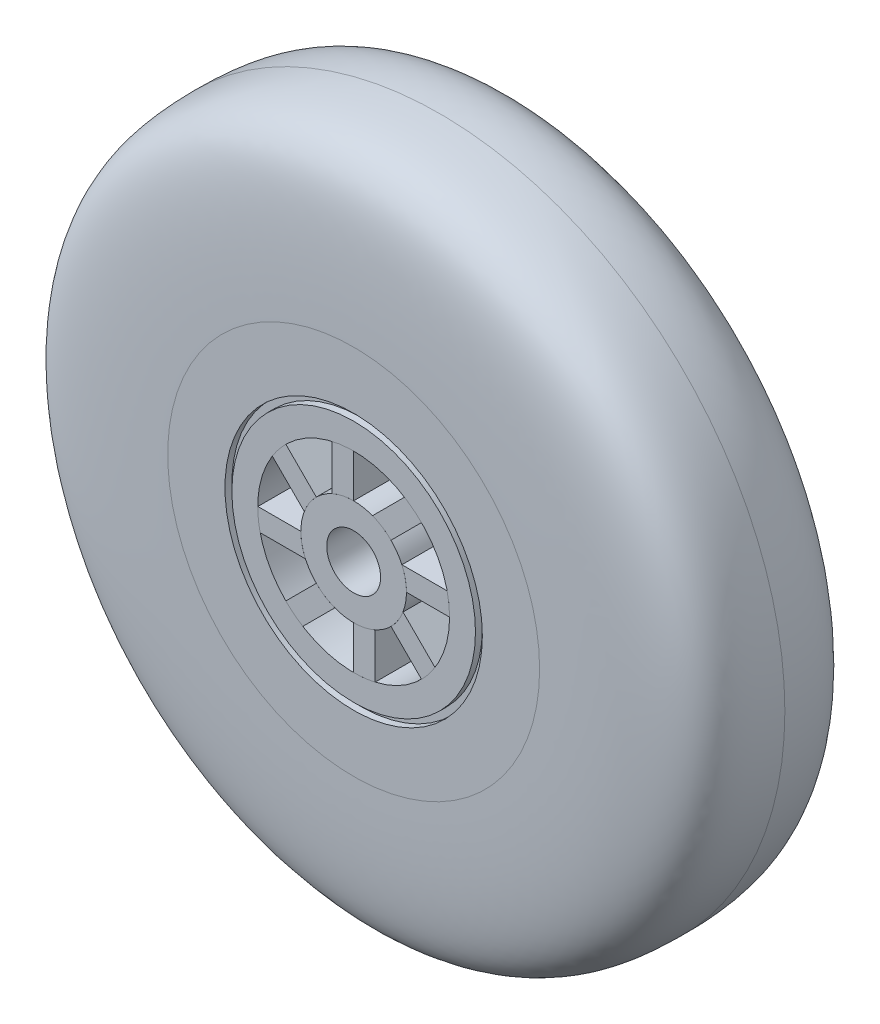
from build123d import *

# Parameters (mm, degrees)
SKETCH2_W             = 12.7
SKETCH2_H             = 3.81
BOSS_EXTRUDE1_DEPTH   = 12.7
BOSS_EXTRUDE1_2_DEPTH = 12.7
BOSS_EXTRUDE1_3_DEPTH = 12.7
BOSS_EXTRUDE1_4_DEPTH = 12.7
BOSS_EXTRUDE1_5_DEPTH = 12.7
BOSS_EXTRUDE1_6_DEPTH = 12.7
BOSS_EXTRUDE1_7_DEPTH = 12.7
BOSS_EXTRUDE1_8_DEPTH = 12.7


with BuildPart() as part:
    # Sketch2 → Revolve1 (revolve)
    with BuildSketch(Plane(origin=(0, 0, 0), x_dir=(0, 0, -1), z_dir=(1, 0, 0)), mode=Mode.PRIVATE) as revolve1_sk:
        with BuildLine():
            Line((-12.7, 27.384375), (-12.7, 18.95475))
            Line((-12.7, 18.95475), (-11.684, 18.95475))
            Line((-11.684, 18.95475), (-11.684, 17.93875))
            Line((-11.684, 17.93875), (-12.7, 17.93875))
            Line((-12.7, 17.93875), (-12.7, 14.12875))
            Line((-12.7, 14.12875), (0, 14.12875))
            Line((0, 14.12875), (0, 50.8))
            add(Edge.make_bspline(
                [(0, 50.8), (-12.7, 50.8), (-12.7, 27.384375)],
                knots=[0, 0, 0, 1, 1, 1], degree=2, weights=[1, 2.072916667, 1]))
        make_face()
        with Locations((-6.35, 5.87375)):
            Rectangle(SKETCH2_W, SKETCH2_H)
    revolve(revolve1_sk.sketch.rotate(Axis((0, 0, 12.7), (0, 0, -1)), 90), axis=Axis((0, 0, 12.7), (0, 0, -1)))


with BuildPart() as body_2:
    # Sketch3 → Boss-Extrude1 (new body)
    with BuildSketch(Plane.XY.offset(12.7)):
        with BuildLine():
            Line((2.776306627, 7.266434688), (7.48994885, 11.980076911))
            ThreePointArc((7.48994885, 11.980076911), (8.796669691, 11.05622806), (9.990534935, 9.990534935))
            Line((9.990534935, 9.990534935), (5.500406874, 5.500406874))
            ThreePointArc((5.500406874, 5.500406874), (4.231513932, 6.527115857), (2.776306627, 7.266434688))
        make_face()
    extrude(amount=-BOSS_EXTRUDE1_DEPTH)


with BuildPart() as body_3:
    # Sketch3 → Boss-Extrude1 2 (new body)
    with BuildSketch(Plane.XY.offset(12.7)):
        with BuildLine():
            Line((7.101290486, 3.175), (13.767387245, 3.175))
            ThreePointArc((13.767387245, 3.175), (14.038118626, 1.597749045), (14.12875, 0))
            Line((14.12875, 0), (7.77875, 0))
            ThreePointArc((7.77875, 0), (7.60750008, 1.623235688), (7.101290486, 3.175))
        make_face()
    extrude(amount=-BOSS_EXTRUDE1_2_DEPTH)


with BuildPart() as body_4:
    # Sketch3 → Boss-Extrude1 3 (new body)
    with BuildSketch(Plane.XY.offset(12.7)):
        with BuildLine():
            Line((7.266434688, -2.776306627), (11.980076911, -7.48994885))
            ThreePointArc((11.980076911, -7.48994885), (11.05622806, -8.796669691), (9.990534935, -9.990534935))
            Line((9.990534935, -9.990534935), (5.500406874, -5.500406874))
            ThreePointArc((5.500406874, -5.500406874), (6.527115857, -4.231513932), (7.266434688, -2.776306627))
        make_face()
    extrude(amount=-BOSS_EXTRUDE1_3_DEPTH)


with BuildPart() as body_5:
    # Sketch3 → Boss-Extrude1 4 (new body)
    with BuildSketch(Plane.XY.offset(12.7)):
        with BuildLine():
            Line((3.175, -7.101290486), (3.175, -13.767387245))
            ThreePointArc((3.175, -13.767387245), (1.597749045, -14.038118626), (0, -14.12875))
            Line((0, -14.12875), (0, -7.77875))
            ThreePointArc((0, -7.77875), (1.623235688, -7.60750008), (3.175, -7.101290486))
        make_face()
    extrude(amount=-BOSS_EXTRUDE1_4_DEPTH)


with BuildPart() as body_6:
    # Sketch3 → Boss-Extrude1 5 (new body)
    with BuildSketch(Plane.XY.offset(12.7)):
        with BuildLine():
            Line((-2.776306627, -7.266434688), (-7.48994885, -11.980076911))
            ThreePointArc((-7.48994885, -11.980076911), (-8.796669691, -11.05622806), (-9.990534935, -9.990534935))
            Line((-9.990534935, -9.990534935), (-5.500406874, -5.500406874))
            ThreePointArc((-5.500406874, -5.500406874), (-4.231513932, -6.527115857), (-2.776306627, -7.266434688))
        make_face()
    extrude(amount=-BOSS_EXTRUDE1_5_DEPTH)


with BuildPart() as body_7:
    # Sketch3 → Boss-Extrude1 6 (new body)
    with BuildSketch(Plane.XY.offset(12.7)):
        with BuildLine():
            Line((-7.101290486, -3.175), (-13.767387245, -3.175))
            ThreePointArc((-13.767387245, -3.175), (-14.038118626, -1.597749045), (-14.12875, 0))
            Line((-14.12875, 0), (-7.77875, 0))
            ThreePointArc((-7.77875, 0), (-7.60750008, -1.623235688), (-7.101290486, -3.175))
        make_face()
    extrude(amount=-BOSS_EXTRUDE1_6_DEPTH)


with BuildPart() as body_8:
    # Sketch3 → Boss-Extrude1 7 (new body)
    with BuildSketch(Plane.XY.offset(12.7)):
        with BuildLine():
            Line((-7.266434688, 2.776306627), (-11.980076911, 7.48994885))
            ThreePointArc((-11.980076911, 7.48994885), (-11.05622806, 8.796669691), (-9.990534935, 9.990534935))
            Line((-9.990534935, 9.990534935), (-5.500406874, 5.500406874))
            ThreePointArc((-5.500406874, 5.500406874), (-6.527115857, 4.231513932), (-7.266434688, 2.776306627))
        make_face()
    extrude(amount=-BOSS_EXTRUDE1_7_DEPTH)


with BuildPart() as body_9:
    # Sketch3 → Boss-Extrude1 8 (new body)
    with BuildSketch(Plane.XY.offset(12.7)):
        with BuildLine():
            Line((-3.175, 7.101290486), (-3.175, 13.767387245))
            ThreePointArc((-3.175, 13.767387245), (-1.597749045, 14.038118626), (0, 14.12875))
            Line((0, 14.12875), (0, 7.77875))
            ThreePointArc((0, 7.77875), (-1.623235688, 7.60750008), (-3.175, 7.101290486))
        make_face()
    extrude(amount=-BOSS_EXTRUDE1_8_DEPTH)


with BuildPart() as body_10:
    # Mirror1: mirrored copy
    add(part.part.mirror(Plane.XY))


with BuildPart() as body_11:
    # Mirror1 2: mirrored copy
    add(body_2.part.mirror(Plane.XY))


with BuildPart() as body_12:
    # Mirror1 3: mirrored copy
    add(body_3.part.mirror(Plane.XY))


with BuildPart() as body_13:
    # Mirror1 4: mirrored copy
    add(body_4.part.mirror(Plane.XY))


with BuildPart() as body_14:
    # Mirror1 5: mirrored copy
    add(body_5.part.mirror(Plane.XY))


with BuildPart() as body_15:
    # Mirror1 6: mirrored copy
    add(body_6.part.mirror(Plane.XY))


with BuildPart() as body_16:
    # Mirror1 7: mirrored copy
    add(body_7.part.mirror(Plane.XY))


with BuildPart() as body_17:
    # Mirror1 8: mirrored copy
    add(body_8.part.mirror(Plane.XY))


with BuildPart() as body_18:
    # Mirror1 9: mirrored copy
    add(body_9.part.mirror(Plane.XY))


solid = Compound([part.part, body_2.part, body_3.part, body_4.part, body_5.part, body_6.part, body_7.part, body_8.part, body_9.part, body_10.part, body_11.part, body_12.part, body_13.part, body_14.part, body_15.part, body_16.part, body_17.part, body_18.part])
